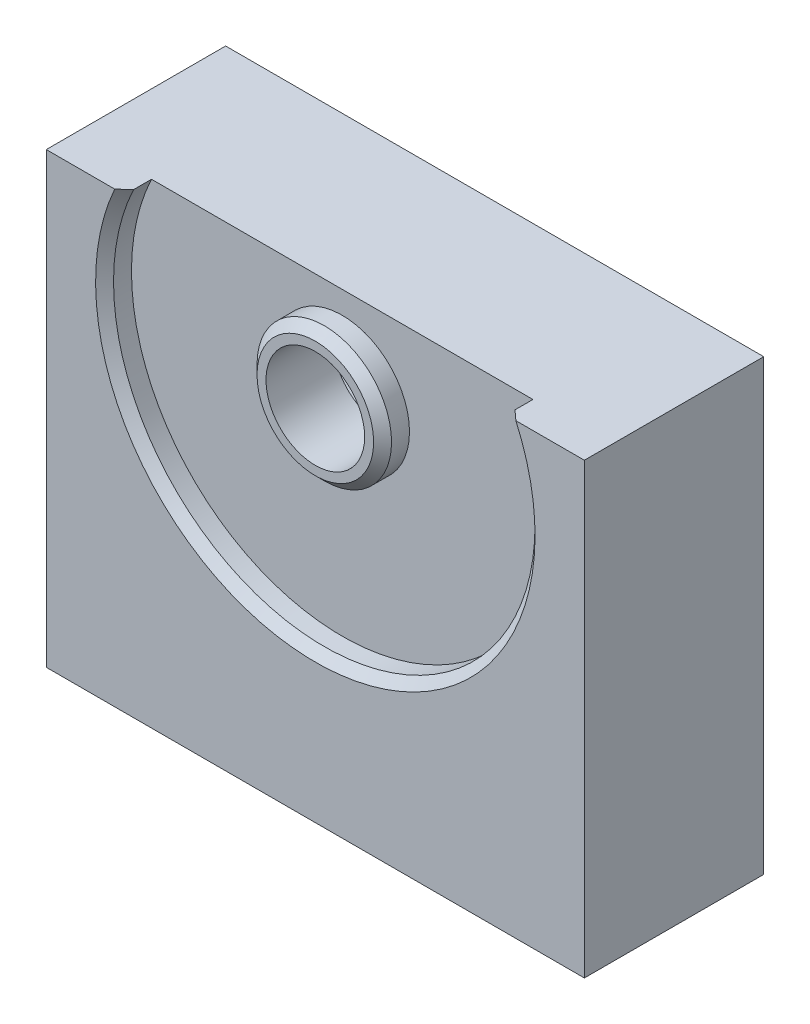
ISO-10303-21;
HEADER;
FILE_DESCRIPTION(('STEP AP214'),'2;1');
FILE_NAME('part.step','',(''),(''),'','','');
FILE_SCHEMA(('AUTOMOTIVE_DESIGN { 1 0 10303 214 1 1 1 1 }'));
ENDSEC;
DATA;
#1=APPLICATION_CONTEXT('core data for automotive mechanical design processes');
#2=APPLICATION_PROTOCOL_DEFINITION('international standard','automotive_design',2000,#1);
#3=PRODUCT_CONTEXT('',#1,'mechanical');
#4=PRODUCT('Part','Part','',(#3));
#5=PRODUCT_RELATED_PRODUCT_CATEGORY('part','',(#4));
#6=PRODUCT_DEFINITION_FORMATION('','',#4);
#7=PRODUCT_DEFINITION_CONTEXT('part definition',#1,'design');
#8=PRODUCT_DEFINITION('design','',#6,#7);
#9=PRODUCT_DEFINITION_SHAPE('','',#8);
#10=(LENGTH_UNIT() NAMED_UNIT(*) SI_UNIT(.MILLI.,.METRE.));
#11=(NAMED_UNIT(*) PLANE_ANGLE_UNIT() SI_UNIT($,.RADIAN.));
#12=(NAMED_UNIT(*) SI_UNIT($,.STERADIAN.) SOLID_ANGLE_UNIT());
#13=UNCERTAINTY_MEASURE_WITH_UNIT(LENGTH_MEASURE(1.E-05),#10,'distance_accuracy_value','');
#14=(GEOMETRIC_REPRESENTATION_CONTEXT(3) GLOBAL_UNCERTAINTY_ASSIGNED_CONTEXT((#13)) GLOBAL_UNIT_ASSIGNED_CONTEXT((#10,
#11,#12)) REPRESENTATION_CONTEXT('',''));
#15=CARTESIAN_POINT('',(0.,0.,0.));
#16=DIRECTION('',(0.,0.,1.));
#17=DIRECTION('',(1.,0.,0.));
#18=AXIS2_PLACEMENT_3D('',#15,#16,#17);
#19=CARTESIAN_POINT('',(0.,0.,20.));
#20=DIRECTION('',(1.,0.,0.));
#21=DIRECTION('',(0.,0.,-1.));
#22=AXIS2_PLACEMENT_3D('',#19,#20,#21);
#23=PLANE('',#22);
#24=DIRECTION('',(0.,-1.,0.));
#25=VECTOR('',#24,1.);
#26=CARTESIAN_POINT('',(0.,0.,0.));
#27=LINE('',#26,#25);
#28=CARTESIAN_POINT('',(0.,50.,0.));
#29=VERTEX_POINT('',#28);
#30=CARTESIAN_POINT('',(0.,0.,0.));
#31=VERTEX_POINT('',#30);
#32=EDGE_CURVE('E125',#29,#31,#27,.T.);
#33=ORIENTED_EDGE('',*,*,#32,.T.);
#34=DIRECTION('',(0.,0.,-1.));
#35=VECTOR('',#34,1.);
#36=CARTESIAN_POINT('',(0.,0.,20.));
#37=LINE('',#36,#35);
#38=CARTESIAN_POINT('',(0.,0.,20.));
#39=VERTEX_POINT('',#38);
#40=EDGE_CURVE('E154',#39,#31,#37,.T.);
#41=ORIENTED_EDGE('',*,*,#40,.F.);
#42=DIRECTION('',(0.,-1.,0.));
#43=VECTOR('',#42,1.);
#44=CARTESIAN_POINT('',(0.,0.,20.));
#45=LINE('',#44,#43);
#46=CARTESIAN_POINT('',(0.,50.,20.));
#47=VERTEX_POINT('',#46);
#48=EDGE_CURVE('E126',#47,#39,#45,.T.);
#49=ORIENTED_EDGE('',*,*,#48,.F.);
#50=DIRECTION('',(0.,0.,-1.));
#51=VECTOR('',#50,1.);
#52=CARTESIAN_POINT('',(0.,50.,20.));
#53=LINE('',#52,#51);
#54=EDGE_CURVE('E138',#47,#29,#53,.T.);
#55=ORIENTED_EDGE('',*,*,#54,.T.);
#56=EDGE_LOOP('',(#33,#41,#49,#55));
#57=FACE_BOUND('',#56,.T.);
#58=ADVANCED_FACE('F40',(#57),#23,.F.);
#59=CARTESIAN_POINT('',(0.,0.,20.));
#60=DIRECTION('',(0.,1.,0.));
#61=DIRECTION('',(0.,0.,1.));
#62=AXIS2_PLACEMENT_3D('',#59,#60,#61);
#63=PLANE('',#62);
#64=DIRECTION('',(1.,0.,0.));
#65=VECTOR('',#64,1.);
#66=CARTESIAN_POINT('',(0.,0.,0.));
#67=LINE('',#66,#65);
#68=CARTESIAN_POINT('',(60.,0.,0.));
#69=VERTEX_POINT('',#68);
#70=EDGE_CURVE('E141',#31,#69,#67,.T.);
#71=ORIENTED_EDGE('',*,*,#70,.T.);
#72=DIRECTION('',(0.,0.,-1.));
#73=VECTOR('',#72,1.);
#74=CARTESIAN_POINT('',(60.,0.,20.));
#75=LINE('',#74,#73);
#76=CARTESIAN_POINT('',(60.,0.,20.));
#77=VERTEX_POINT('',#76);
#78=EDGE_CURVE('E151',#77,#69,#75,.T.);
#79=ORIENTED_EDGE('',*,*,#78,.F.);
#80=DIRECTION('',(1.,0.,0.));
#81=VECTOR('',#80,1.);
#82=CARTESIAN_POINT('',(0.,0.,20.));
#83=LINE('',#82,#81);
#84=EDGE_CURVE('E129',#39,#77,#83,.T.);
#85=ORIENTED_EDGE('',*,*,#84,.F.);
#86=ORIENTED_EDGE('',*,*,#40,.T.);
#87=EDGE_LOOP('',(#71,#79,#85,#86));
#88=FACE_BOUND('',#87,.T.);
#89=ADVANCED_FACE('F188',(#88),#63,.F.);
#90=CARTESIAN_POINT('',(60.,0.,20.));
#91=DIRECTION('',(-1.,0.,0.));
#92=DIRECTION('',(0.,0.,1.));
#93=AXIS2_PLACEMENT_3D('',#90,#91,#92);
#94=PLANE('',#93);
#95=DIRECTION('',(0.,1.,0.));
#96=VECTOR('',#95,1.);
#97=CARTESIAN_POINT('',(60.,0.,0.));
#98=LINE('',#97,#96);
#99=CARTESIAN_POINT('',(60.,50.,0.));
#100=VERTEX_POINT('',#99);
#101=EDGE_CURVE('E143',#69,#100,#98,.T.);
#102=ORIENTED_EDGE('',*,*,#101,.T.);
#103=DIRECTION('',(0.,0.,-1.));
#104=VECTOR('',#103,1.);
#105=CARTESIAN_POINT('',(60.,50.,20.));
#106=LINE('',#105,#104);
#107=CARTESIAN_POINT('',(60.,50.,20.));
#108=VERTEX_POINT('',#107);
#109=EDGE_CURVE('E148',#108,#100,#106,.T.);
#110=ORIENTED_EDGE('',*,*,#109,.F.);
#111=DIRECTION('',(0.,1.,0.));
#112=VECTOR('',#111,1.);
#113=CARTESIAN_POINT('',(60.,0.,20.));
#114=LINE('',#113,#112);
#115=EDGE_CURVE('E132',#77,#108,#114,.T.);
#116=ORIENTED_EDGE('',*,*,#115,.F.);
#117=ORIENTED_EDGE('',*,*,#78,.T.);
#118=EDGE_LOOP('',(#102,#110,#116,#117));
#119=FACE_BOUND('',#118,.T.);
#120=ADVANCED_FACE('F182',(#119),#94,.F.);
#121=CARTESIAN_POINT('',(0.,50.,20.));
#122=DIRECTION('',(0.,-1.,0.));
#123=DIRECTION('',(0.,0.,-1.));
#124=AXIS2_PLACEMENT_3D('',#121,#122,#123);
#125=PLANE('',#124);
#126=DIRECTION('',(-1.,0.,0.));
#127=VECTOR('',#126,1.);
#128=CARTESIAN_POINT('',(0.,50.,20.));
#129=LINE('',#128,#127);
#130=CARTESIAN_POINT('',(7.63373075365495,50.,20.));
#131=VERTEX_POINT('',#130);
#132=EDGE_CURVE('E134',#131,#47,#129,.T.);
#133=ORIENTED_EDGE('',*,*,#132,.F.);
#134=CARTESIAN_POINT('',(7.63373075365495,50.,20.));
#135=CARTESIAN_POINT('',(7.81671726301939,50.,19.8329336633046));
#136=CARTESIAN_POINT('',(7.99988542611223,50.,19.6660671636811));
#137=CARTESIAN_POINT('',(8.36658506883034,50.,19.332733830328));
#138=CARTESIAN_POINT('',(8.55011654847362,50.,19.1662669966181));
#139=CARTESIAN_POINT('',(8.73382968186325,50.,19.));
#140=B_SPLINE_CURVE_WITH_KNOTS('',3,(#134,#135,#136,#137,#138,#139),.UNSPECIFIED.,.F.,.F.,(4,2,
4),(0.,0.743340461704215,1.48668096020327),.UNSPECIFIED.);
#141=CARTESIAN_POINT('',(8.73382968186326,50.,19.));
#142=VERTEX_POINT('',#141);
#143=EDGE_CURVE('E55',#131,#142,#140,.T.);
#144=ORIENTED_EDGE('',*,*,#143,.T.);
#145=DIRECTION('',(0.,0.,1.));
#146=VECTOR('',#145,1.);
#147=CARTESIAN_POINT('',(8.73382968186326,50.,17.));
#148=LINE('',#147,#146);
#149=CARTESIAN_POINT('',(8.73382968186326,50.,17.));
#150=VERTEX_POINT('',#149);
#151=EDGE_CURVE('E121',#142,#150,#148,.F.);
#152=ORIENTED_EDGE('',*,*,#151,.T.);
#153=DIRECTION('',(-1.,0.,0.));
#154=VECTOR('',#153,1.);
#155=CARTESIAN_POINT('',(0.,50.,17.));
#156=LINE('',#155,#154);
#157=CARTESIAN_POINT('',(51.2661703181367,50.,17.));
#158=VERTEX_POINT('',#157);
#159=EDGE_CURVE('E157',#158,#150,#156,.T.);
#160=ORIENTED_EDGE('',*,*,#159,.F.);
#161=DIRECTION('',(0.,0.,1.));
#162=VECTOR('',#161,1.);
#163=CARTESIAN_POINT('',(51.2661703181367,50.,17.));
#164=LINE('',#163,#162);
#165=CARTESIAN_POINT('',(51.2661703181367,50.,19.));
#166=VERTEX_POINT('',#165);
#167=EDGE_CURVE('E123',#158,#166,#164,.T.);
#168=ORIENTED_EDGE('',*,*,#167,.T.);
#169=CARTESIAN_POINT('',(51.2661703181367,50.,19.));
#170=CARTESIAN_POINT('',(51.4498834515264,50.,19.1662669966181));
#171=CARTESIAN_POINT('',(51.6334149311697,50.,19.332733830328));
#172=CARTESIAN_POINT('',(52.0001145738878,50.,19.6660671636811));
#173=CARTESIAN_POINT('',(52.1832827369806,50.,19.8329336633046));
#174=CARTESIAN_POINT('',(52.366269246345,50.,20.));
#175=B_SPLINE_CURVE_WITH_KNOTS('',3,(#169,#170,#171,#172,#173,#174),.UNSPECIFIED.,.F.,.F.,(4,2,
4),(0.,0.743340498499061,1.48668096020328),.UNSPECIFIED.);
#176=CARTESIAN_POINT('',(52.366269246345,50.,20.));
#177=VERTEX_POINT('',#176);
#178=EDGE_CURVE('E163',#166,#177,#175,.T.);
#179=ORIENTED_EDGE('',*,*,#178,.T.);
#180=EDGE_CURVE('E135',#108,#177,#129,.T.);
#181=ORIENTED_EDGE('',*,*,#180,.F.);
#182=ORIENTED_EDGE('',*,*,#109,.T.);
#183=DIRECTION('',(-1.,0.,0.));
#184=VECTOR('',#183,1.);
#185=CARTESIAN_POINT('',(0.,50.,0.));
#186=LINE('',#185,#184);
#187=EDGE_CURVE('E130',#100,#29,#186,.T.);
#188=ORIENTED_EDGE('',*,*,#187,.T.);
#189=ORIENTED_EDGE('',*,*,#54,.F.);
#190=EDGE_LOOP('',(#133,#144,#152,#160,#168,#179,#181,#182,#188,#189));
#191=FACE_BOUND('',#190,.T.);
#192=ADVANCED_FACE('F176',(#191),#125,.F.);
#193=CARTESIAN_POINT('',(0.,0.,20.));
#194=DIRECTION('',(0.,0.,-1.));
#195=DIRECTION('',(-1.,0.,0.));
#196=AXIS2_PLACEMENT_3D('',#193,#194,#195);
#197=PLANE('',#196);
#198=ORIENTED_EDGE('',*,*,#180,.T.);
#199=CARTESIAN_POINT('',(30.,40.,20.));
#200=DIRECTION('',(0.,0.,-1.));
#201=DIRECTION('',(-1.,0.,0.));
#202=AXIS2_PLACEMENT_3D('',#199,#200,#201);
#203=CIRCLE('',#202,24.5);
#204=EDGE_CURVE('E160',#177,#131,#203,.T.);
#205=ORIENTED_EDGE('',*,*,#204,.T.);
#206=ORIENTED_EDGE('',*,*,#132,.T.);
#207=ORIENTED_EDGE('',*,*,#48,.T.);
#208=ORIENTED_EDGE('',*,*,#84,.T.);
#209=ORIENTED_EDGE('',*,*,#115,.T.);
#210=EDGE_LOOP('',(#198,#205,#206,#207,#208,#209));
#211=FACE_BOUND('',#210,.T.);
#212=ADVANCED_FACE('F181',(#211),#197,.F.);
#213=CARTESIAN_POINT('',(0.,0.,0.));
#214=DIRECTION('',(0.,0.,-1.));
#215=DIRECTION('',(-1.,0.,0.));
#216=AXIS2_PLACEMENT_3D('',#213,#214,#215);
#217=PLANE('',#216);
#218=ORIENTED_EDGE('',*,*,#32,.F.);
#219=ORIENTED_EDGE('',*,*,#187,.F.);
#220=ORIENTED_EDGE('',*,*,#101,.F.);
#221=ORIENTED_EDGE('',*,*,#70,.F.);
#222=EDGE_LOOP('',(#218,#219,#220,#221));
#223=FACE_BOUND('',#222,.T.);
#224=ADVANCED_FACE('F183',(#223),#217,.T.);
#225=CARTESIAN_POINT('',(30.,40.,17.));
#226=DIRECTION('',(0.,0.,1.));
#227=DIRECTION('',(1.,0.,0.));
#228=AXIS2_PLACEMENT_3D('',#225,#226,#227);
#229=PLANE('',#228);
#230=CARTESIAN_POINT('',(30.,40.,17.));
#231=DIRECTION('',(0.,0.,1.));
#232=DIRECTION('',(1.,0.,0.));
#233=AXIS2_PLACEMENT_3D('',#230,#231,#232);
#234=CIRCLE('',#233,7.5);
#235=CARTESIAN_POINT('',(37.5,40.,17.));
#236=VERTEX_POINT('',#235);
#237=EDGE_CURVE('E109',#236,#236,#234,.T.);
#238=ORIENTED_EDGE('',*,*,#237,.F.);
#239=EDGE_LOOP('',(#238));
#240=FACE_BOUND('',#239,.T.);
#241=ORIENTED_EDGE('',*,*,#159,.T.);
#242=CARTESIAN_POINT('',(30.,40.,17.));
#243=DIRECTION('',(0.,0.,1.));
#244=DIRECTION('',(1.,0.,0.));
#245=AXIS2_PLACEMENT_3D('',#242,#243,#244);
#246=CIRCLE('',#245,23.5);
#247=EDGE_CURVE('E113',#150,#158,#246,.T.);
#248=ORIENTED_EDGE('',*,*,#247,.T.);
#249=EDGE_LOOP('',(#241,#248));
#250=FACE_BOUND('',#249,.T.);
#251=ADVANCED_FACE('F230',(#240,#250),#229,.T.);
#252=CARTESIAN_POINT('',(30.,40.,17.));
#253=DIRECTION('',(0.,0.,1.));
#254=DIRECTION('',(1.,0.,0.));
#255=AXIS2_PLACEMENT_3D('',#252,#253,#254);
#256=CYLINDRICAL_SURFACE('',#255,23.5);
#257=ORIENTED_EDGE('',*,*,#151,.F.);
#258=CARTESIAN_POINT('',(30.,40.,19.));
#259=DIRECTION('',(0.,0.,-1.));
#260=DIRECTION('',(-1.,0.,0.));
#261=AXIS2_PLACEMENT_3D('',#258,#259,#260);
#262=CIRCLE('',#261,23.5);
#263=EDGE_CURVE('E62',#142,#166,#262,.F.);
#264=ORIENTED_EDGE('',*,*,#263,.T.);
#265=ORIENTED_EDGE('',*,*,#167,.F.);
#266=ORIENTED_EDGE('',*,*,#247,.F.);
#267=EDGE_LOOP('',(#257,#264,#265,#266));
#268=FACE_BOUND('',#267,.T.);
#269=ADVANCED_FACE('F226',(#268),#256,.F.);
#270=CARTESIAN_POINT('',(30.,40.,17.));
#271=DIRECTION('',(0.,0.,1.));
#272=DIRECTION('',(1.,0.,0.));
#273=AXIS2_PLACEMENT_3D('',#270,#271,#272);
#274=CYLINDRICAL_SURFACE('',#273,7.5);
#275=CARTESIAN_POINT('',(30.,40.,19.));
#276=DIRECTION('',(0.,0.,-1.));
#277=DIRECTION('',(-1.,0.,0.));
#278=AXIS2_PLACEMENT_3D('',#275,#276,#277);
#279=CIRCLE('',#278,7.5);
#280=CARTESIAN_POINT('',(22.5,40.,19.));
#281=VERTEX_POINT('',#280);
#282=EDGE_CURVE('E12',#281,#281,#279,.T.);
#283=ORIENTED_EDGE('',*,*,#282,.T.);
#284=EDGE_LOOP('',(#283));
#285=FACE_BOUND('',#284,.T.);
#286=ORIENTED_EDGE('',*,*,#237,.T.);
#287=EDGE_LOOP('',(#286));
#288=FACE_BOUND('',#287,.T.);
#289=ADVANCED_FACE('F223',(#285,#288),#274,.T.);
#290=CARTESIAN_POINT('',(30.,40.,20.));
#291=DIRECTION('',(0.,0.,1.));
#292=DIRECTION('',(1.,0.,0.));
#293=AXIS2_PLACEMENT_3D('',#290,#291,#292);
#294=CIRCLE('',#293,5.5);
#295=CARTESIAN_POINT('',(35.5,40.,20.));
#296=VERTEX_POINT('',#295);
#297=EDGE_CURVE('E110',#296,#296,#294,.T.);
#298=ORIENTED_EDGE('',*,*,#297,.F.);
#299=EDGE_LOOP('',(#298));
#300=FACE_BOUND('',#299,.T.);
#301=CARTESIAN_POINT('',(30.,40.,20.));
#302=DIRECTION('',(0.,0.,-1.));
#303=DIRECTION('',(-1.,0.,0.));
#304=AXIS2_PLACEMENT_3D('',#301,#302,#303);
#305=CIRCLE('',#304,6.49999999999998);
#306=CARTESIAN_POINT('',(23.5,40.,20.));
#307=VERTEX_POINT('',#306);
#308=EDGE_CURVE('E48',#307,#307,#305,.F.);
#309=ORIENTED_EDGE('',*,*,#308,.T.);
#310=EDGE_LOOP('',(#309));
#311=FACE_BOUND('',#310,.T.);
#312=ADVANCED_FACE('F214',(#300,#311),#197,.F.);
#313=CARTESIAN_POINT('',(30.,40.,20.));
#314=DIRECTION('',(0.,0.,1.));
#315=DIRECTION('',(1.,0.,0.));
#316=AXIS2_PLACEMENT_3D('',#313,#314,#315);
#317=CONICAL_SURFACE('',#316,24.5,0.785398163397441);
#318=ORIENTED_EDGE('',*,*,#178,.F.);
#319=ORIENTED_EDGE('',*,*,#263,.F.);
#320=ORIENTED_EDGE('',*,*,#143,.F.);
#321=ORIENTED_EDGE('',*,*,#204,.F.);
#322=EDGE_LOOP('',(#318,#319,#320,#321));
#323=FACE_BOUND('',#322,.T.);
#324=ADVANCED_FACE('F173',(#323),#317,.F.);
#325=CARTESIAN_POINT('',(30.,40.,20.));
#326=DIRECTION('',(0.,0.,-1.));
#327=DIRECTION('',(-1.,0.,0.));
#328=AXIS2_PLACEMENT_3D('',#325,#326,#327);
#329=CONICAL_SURFACE('',#328,6.49999999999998,0.785398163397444);
#330=ORIENTED_EDGE('',*,*,#282,.F.);
#331=EDGE_LOOP('',(#330));
#332=FACE_BOUND('',#331,.T.);
#333=ORIENTED_EDGE('',*,*,#308,.F.);
#334=EDGE_LOOP('',(#333));
#335=FACE_BOUND('',#334,.T.);
#336=ADVANCED_FACE('F42',(#332,#335),#329,.T.);
#337=CARTESIAN_POINT('',(30.,40.,12.5));
#338=DIRECTION('',(0.,0.,1.));
#339=DIRECTION('',(1.,0.,0.));
#340=AXIS2_PLACEMENT_3D('',#337,#338,#339);
#341=CONICAL_SURFACE('',#340,5.5,1.02974425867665);
#342=CARTESIAN_POINT('',(30.,40.,9.19526659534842));
#343=VERTEX_POINT('',#342);
#344=VERTEX_LOOP('',#343);
#345=FACE_BOUND('',#344,.T.);
#346=CARTESIAN_POINT('',(30.,40.,12.5));
#347=DIRECTION('',(0.,0.,1.));
#348=DIRECTION('',(1.,0.,0.));
#349=AXIS2_PLACEMENT_3D('',#346,#347,#348);
#350=CIRCLE('',#349,5.5);
#351=CARTESIAN_POINT('',(35.5,40.,12.5));
#352=VERTEX_POINT('',#351);
#353=EDGE_CURVE('E107',#352,#352,#350,.T.);
#354=ORIENTED_EDGE('',*,*,#353,.T.);
#355=EDGE_LOOP('',(#354));
#356=FACE_BOUND('',#355,.T.);
#357=ADVANCED_FACE('F100',(#345,#356),#341,.F.);
#358=CARTESIAN_POINT('',(30.,40.,20.));
#359=DIRECTION('',(0.,0.,1.));
#360=DIRECTION('',(1.,0.,0.));
#361=AXIS2_PLACEMENT_3D('',#358,#359,#360);
#362=CYLINDRICAL_SURFACE('',#361,5.5);
#363=ORIENTED_EDGE('',*,*,#353,.F.);
#364=EDGE_LOOP('',(#363));
#365=FACE_BOUND('',#364,.T.);
#366=ORIENTED_EDGE('',*,*,#297,.T.);
#367=EDGE_LOOP('',(#366));
#368=FACE_BOUND('',#367,.T.);
#369=ADVANCED_FACE('F103',(#365,#368),#362,.F.);
#370=CLOSED_SHELL('',(#58,#89,#120,#192,#212,#224,#251,#269,#289,#312,#324,#336,#357,#369));
#371=MANIFOLD_SOLID_BREP('B2',#370);
#372=ADVANCED_BREP_SHAPE_REPRESENTATION('',(#18,#371),#14);
#373=SHAPE_DEFINITION_REPRESENTATION(#9,#372);
ENDSEC;
END-ISO-10303-21;
